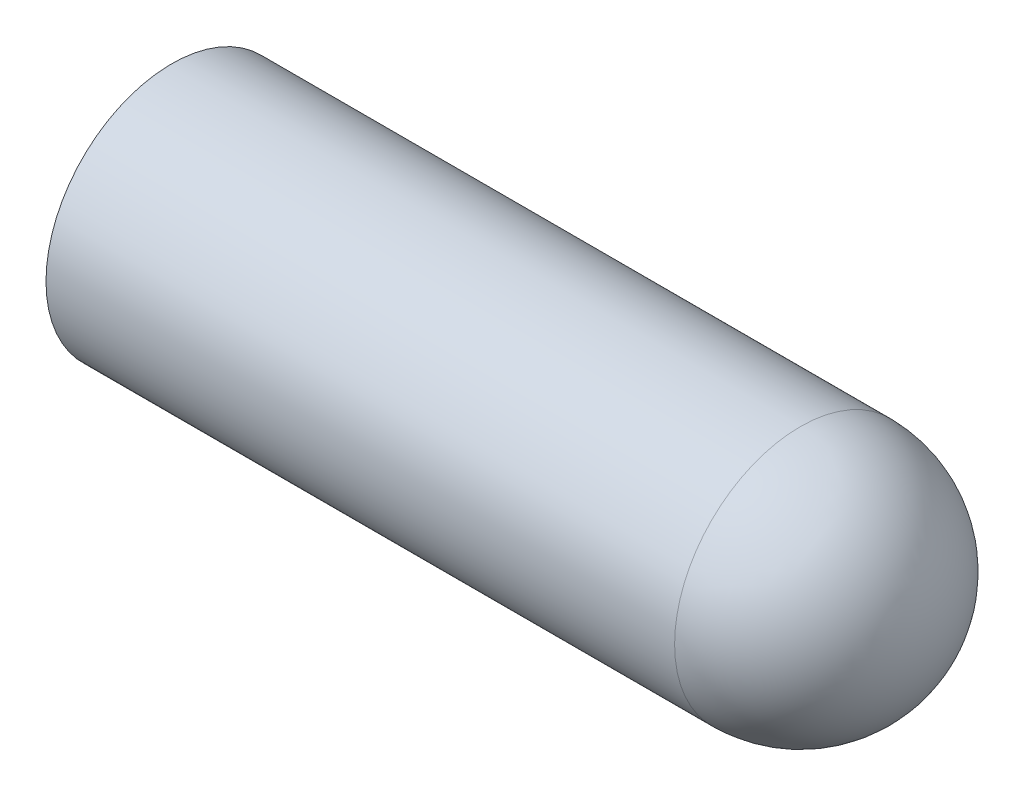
from build123d import *


with BuildPart() as part:
    # Esquisse1 → R_volution1 (revolve)
    with BuildSketch(Plane.XY):
        with BuildLine():
            Line((0, 10), (-50, 10))
            Line((-50, 10), (-50, 8.8))
            Line((-50, 8.8), (0, 8.8))
            ThreePointArc((0, 8.8), (6.222539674, 6.222539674), (8.8, 0))
            Line((8.8, 0), (10, 0))
            ThreePointArc((10, 0), (7.071067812, 7.071067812), (0, 10))
        make_face()
    revolve(axis=Axis((-56.520252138, 0, 0), (1, 0, 0)))


solid = part.part
